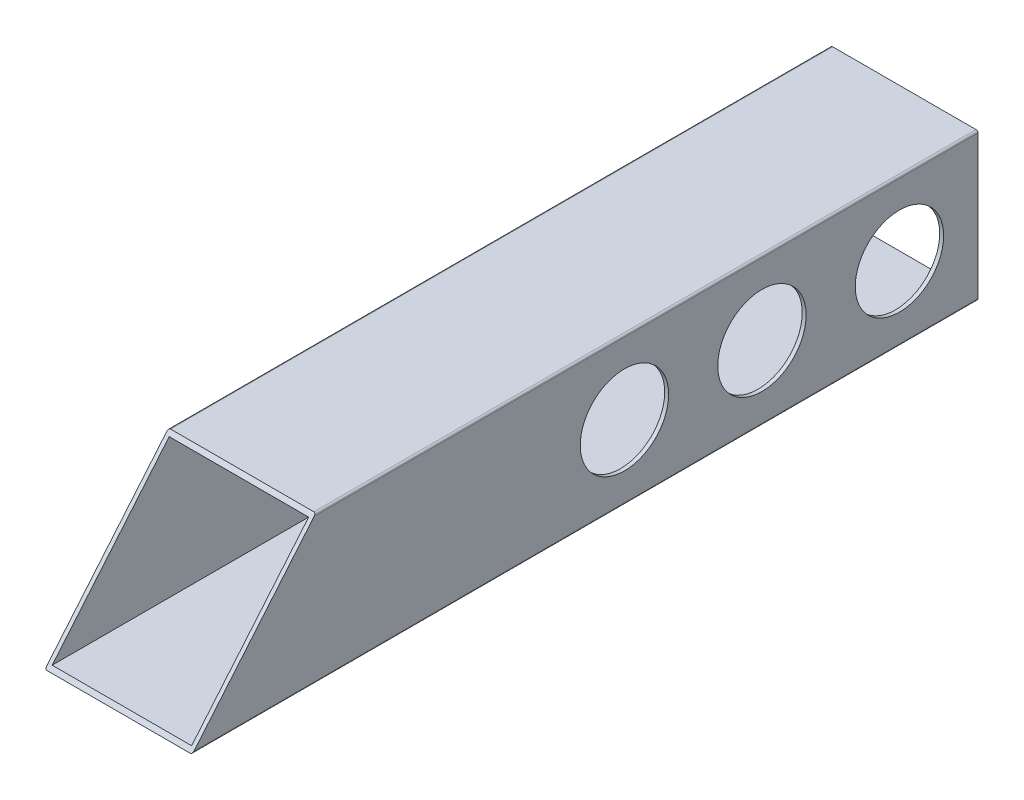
from build123d import *

# Parameters (mm, degrees)
ESQUISSE1_W             = 142
ESQUISSE1_H             = 142
BOSS_EXTRU_1_DEPTH      = 800
ESQUISSE2_R             = 45
ENL_V_MAT_EXTRU_1_DEPTH = 828.647267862


with BuildPart() as part:
    # Esquisse1 → Boss.-Extru.1 (new body)
    with BuildSketch(Plane.XY):
        with BuildLine():
            Line((0, 2), (0, 148))
            ThreePointArc((0, 148), (0.585786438, 149.414213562), (2, 150))
            Line((2, 150), (148, 150))
            ThreePointArc((148, 150), (149.414213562, 149.414213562), (150, 148))
            Line((150, 148), (150, 2))
            ThreePointArc((150, 2), (149.414213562, 0.585786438), (148, 0))
            Line((148, 0), (2, 0))
            ThreePointArc((2, 0), (0.585786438, 0.585786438), (0, 2))
        make_face()
        with Locations((75, 75)):
            Rectangle(ESQUISSE1_W, ESQUISSE1_H, mode=Mode.SUBTRACT)
    extrude(amount=BOSS_EXTRU_1_DEPTH)

    # Esquisse2 → Enl_v. mat.-Extru.1 (cut, through all)
    with BuildSketch(Plane(origin=(150, 0, 0), x_dir=(0, 0, -1), z_dir=(1, 0, 0))):
        with Locations((-80, 75)):
            Circle(ESQUISSE2_R)
        with Locations((-220, 75)):
            Circle(ESQUISSE2_R)
        with Locations((-360, 75)):
            Circle(ESQUISSE2_R)
        Polygon((-800, 0), (-674.135055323, 150), (-800, 150), align=None)
    extrude(amount=-ENL_V_MAT_EXTRU_1_DEPTH, mode=Mode.SUBTRACT)


solid = part.part
